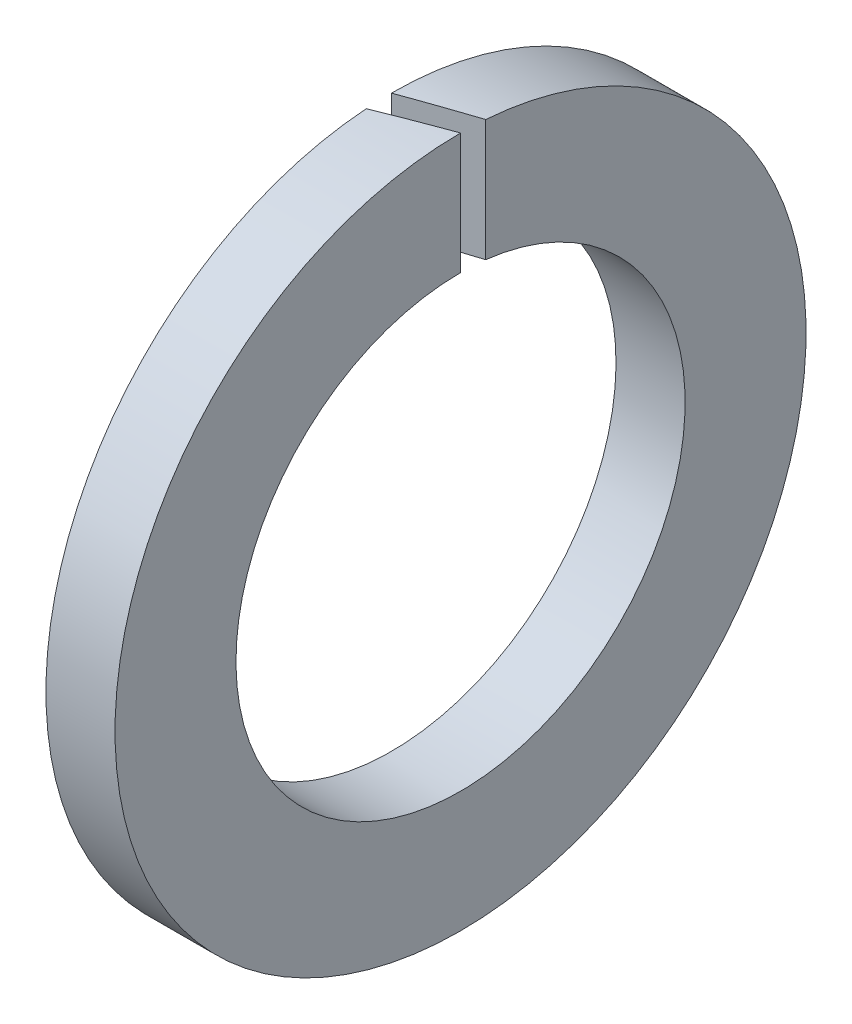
from build123d import *

# Parameters (mm, degrees)
ESQUISSE1_W             = 2
ESQUISSE1_H             = 3.5
ENL_V_MAT_EXTRU_1_DEPTH = 15.282856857


with BuildPart() as part:
    # Esquisse1 → Base-R_volution (revolve)
    with BuildSketch(Plane(origin=(0, 0, 0), x_dir=(1, 0, 0), z_dir=(0, 1, 0)), mode=Mode.PRIVATE) as base_r_volution_sk:
        with Locations((1, 8.25)):
            Rectangle(ESQUISSE1_W, ESQUISSE1_H)
    revolve(base_r_volution_sk.sketch.rotate(Axis((0, 0, 0), (1, 0, 0)), 180), axis=Axis((0, 0, 0), (1, 0, 0)))

    # Esquisse2 → Enl_v. mat.-Extru.1 (cut, through all)
    with BuildSketch(Plane(origin=(0, 0, 0), x_dir=(1, 0, 0), z_dir=(0, 1, 0))):
        Polygon((0, 0), (2, 0.727940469), (2, 0), (0, -0.727940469), align=None)
    extrude(amount=ENL_V_MAT_EXTRU_1_DEPTH, mode=Mode.SUBTRACT)


solid = part.part
